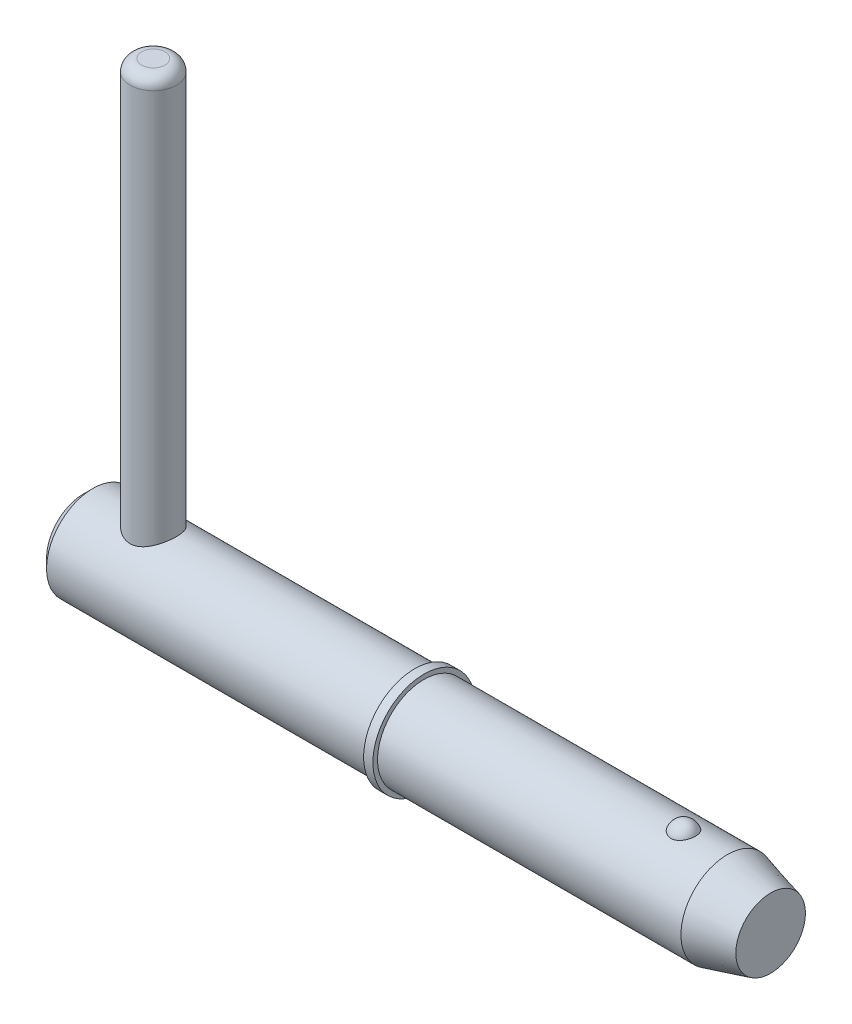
ISO-10303-21;
HEADER;
FILE_DESCRIPTION(('STEP AP214'),'2;1');
FILE_NAME('part.step','',(''),(''),'','','');
FILE_SCHEMA(('AUTOMOTIVE_DESIGN { 1 0 10303 214 1 1 1 1 }'));
ENDSEC;
DATA;
#1=APPLICATION_CONTEXT('core data for automotive mechanical design processes');
#2=APPLICATION_PROTOCOL_DEFINITION('international standard','automotive_design',2000,#1);
#3=PRODUCT_CONTEXT('',#1,'mechanical');
#4=PRODUCT('Part','Part','',(#3));
#5=PRODUCT_RELATED_PRODUCT_CATEGORY('part','',(#4));
#6=PRODUCT_DEFINITION_FORMATION('','',#4);
#7=PRODUCT_DEFINITION_CONTEXT('part definition',#1,'design');
#8=PRODUCT_DEFINITION('design','',#6,#7);
#9=PRODUCT_DEFINITION_SHAPE('','',#8);
#10=(LENGTH_UNIT() NAMED_UNIT(*) SI_UNIT(.MILLI.,.METRE.));
#11=(NAMED_UNIT(*) PLANE_ANGLE_UNIT() SI_UNIT($,.RADIAN.));
#12=(NAMED_UNIT(*) SI_UNIT($,.STERADIAN.) SOLID_ANGLE_UNIT());
#13=UNCERTAINTY_MEASURE_WITH_UNIT(LENGTH_MEASURE(1.E-05),#10,'distance_accuracy_value','');
#14=(GEOMETRIC_REPRESENTATION_CONTEXT(3) GLOBAL_UNCERTAINTY_ASSIGNED_CONTEXT((#13)) GLOBAL_UNIT_ASSIGNED_CONTEXT((#10,
#11,#12)) REPRESENTATION_CONTEXT('',''));
#15=CARTESIAN_POINT('',(0.,0.,0.));
#16=DIRECTION('',(0.,0.,1.));
#17=DIRECTION('',(1.,0.,0.));
#18=AXIS2_PLACEMENT_3D('',#15,#16,#17);
#19=CARTESIAN_POINT('',(3.57,23.02,0.));
#20=DIRECTION('',(0.,-1.,0.));
#21=DIRECTION('',(0.,0.,-1.));
#22=AXIS2_PLACEMENT_3D('',#19,#20,#21);
#23=CYLINDRICAL_SURFACE('',#22,1.19);
#24=CARTESIAN_POINT('',(3.57,-1.785,0.));
#25=DIRECTION('',(0.,1.,0.));
#26=DIRECTION('',(0.,0.,1.));
#27=AXIS2_PLACEMENT_3D('',#24,#25,#26);
#28=CIRCLE('',#27,1.19);
#29=CARTESIAN_POINT('',(3.57,-1.785,1.19));
#30=VERTEX_POINT('',#29);
#31=EDGE_CURVE('P0_E25',#30,#30,#28,.T.);
#32=ORIENTED_EDGE('',*,*,#31,.T.);
#33=EDGE_LOOP('',(#32));
#34=FACE_BOUND('',#33,.T.);
#35=CARTESIAN_POINT('',(3.57,22.425,0.));
#36=DIRECTION('',(0.,1.,0.));
#37=DIRECTION('',(0.,0.,1.));
#38=AXIS2_PLACEMENT_3D('',#35,#36,#37);
#39=CIRCLE('',#38,1.19);
#40=CARTESIAN_POINT('',(3.57,22.425,1.19));
#41=VERTEX_POINT('',#40);
#42=EDGE_CURVE('P0_E29',#41,#41,#39,.F.);
#43=ORIENTED_EDGE('',*,*,#42,.T.);
#44=EDGE_LOOP('',(#43));
#45=FACE_BOUND('',#44,.T.);
#46=ADVANCED_FACE('P0_F14',(#34,#45),#23,.T.);
#47=CARTESIAN_POINT('',(3.57,23.02,0.));
#48=DIRECTION('',(0.,1.,0.));
#49=DIRECTION('',(0.,0.,1.));
#50=AXIS2_PLACEMENT_3D('',#47,#48,#49);
#51=PLANE('',#50);
#52=CARTESIAN_POINT('',(3.57,23.02,0.));
#53=DIRECTION('',(0.,1.,0.));
#54=DIRECTION('',(0.,0.,1.));
#55=AXIS2_PLACEMENT_3D('',#52,#53,#54);
#56=CIRCLE('',#55,0.595);
#57=CARTESIAN_POINT('',(3.57,23.02,0.595));
#58=VERTEX_POINT('',#57);
#59=EDGE_CURVE('P0_E10',#58,#58,#56,.T.);
#60=ORIENTED_EDGE('',*,*,#59,.T.);
#61=EDGE_LOOP('',(#60));
#62=FACE_BOUND('',#61,.T.);
#63=ADVANCED_FACE('P0_F46',(#62),#51,.T.);
#64=CARTESIAN_POINT('',(3.57,-2.38,0.));
#65=DIRECTION('',(0.,1.,0.));
#66=DIRECTION('',(0.,0.,1.));
#67=AXIS2_PLACEMENT_3D('',#64,#65,#66);
#68=PLANE('',#67);
#69=CARTESIAN_POINT('',(3.57,-2.38,0.));
#70=DIRECTION('',(0.,1.,0.));
#71=DIRECTION('',(0.,0.,1.));
#72=AXIS2_PLACEMENT_3D('',#69,#70,#71);
#73=CIRCLE('',#72,0.595);
#74=CARTESIAN_POINT('',(3.57,-2.38,0.595));
#75=VERTEX_POINT('',#74);
#76=EDGE_CURVE('P0_E21',#75,#75,#73,.F.);
#77=ORIENTED_EDGE('',*,*,#76,.T.);
#78=EDGE_LOOP('',(#77));
#79=FACE_BOUND('',#78,.T.);
#80=ADVANCED_FACE('P0_F43',(#79),#68,.F.);
#81=CARTESIAN_POINT('',(3.57,-1.785,0.));
#82=DIRECTION('',(0.,1.,0.));
#83=DIRECTION('',(0.,0.,1.));
#84=AXIS2_PLACEMENT_3D('',#81,#82,#83);
#85=DEGENERATE_TOROIDAL_SURFACE('',#84,0.595,0.595,.T.);
#86=ORIENTED_EDGE('',*,*,#76,.F.);
#87=EDGE_LOOP('',(#86));
#88=FACE_BOUND('',#87,.T.);
#89=ORIENTED_EDGE('',*,*,#31,.F.);
#90=EDGE_LOOP('',(#89));
#91=FACE_BOUND('',#90,.T.);
#92=ADVANCED_FACE('P0_F38',(#88,#91),#85,.T.);
#93=CARTESIAN_POINT('',(3.57,22.425,0.));
#94=DIRECTION('',(0.,1.,0.));
#95=DIRECTION('',(0.,0.,1.));
#96=AXIS2_PLACEMENT_3D('',#93,#94,#95);
#97=DEGENERATE_TOROIDAL_SURFACE('',#96,0.595,0.595,.T.);
#98=ORIENTED_EDGE('',*,*,#42,.F.);
#99=EDGE_LOOP('',(#98));
#100=FACE_BOUND('',#99,.T.);
#101=ORIENTED_EDGE('',*,*,#59,.F.);
#102=EDGE_LOOP('',(#101));
#103=FACE_BOUND('',#102,.T.);
#104=ADVANCED_FACE('P0_F16',(#100,#103),#97,.T.);
#105=CLOSED_SHELL('',(#46,#63,#80,#92,#104));
#106=MANIFOLD_SOLID_BREP('P0_B1',#105);
#107=CARTESIAN_POINT('',(0.,0.,0.));
#108=DIRECTION('',(1.,0.,0.));
#109=DIRECTION('',(0.,0.,-1.));
#110=AXIS2_PLACEMENT_3D('',#107,#108,#109);
#111=CYLINDRICAL_SURFACE('',#110,2.38);
#112=CARTESIAN_POINT('',(33.0094297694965,0.,0.));
#113=DIRECTION('',(1.,0.,0.));
#114=DIRECTION('',(0.,0.,-1.));
#115=AXIS2_PLACEMENT_3D('',#112,#113,#114);
#116=CIRCLE('',#115,2.38);
#117=CARTESIAN_POINT('',(33.0094297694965,0.,-2.38));
#118=VERTEX_POINT('',#117);
#119=EDGE_CURVE('P1_E81',#118,#118,#116,.T.);
#120=ORIENTED_EDGE('',*,*,#119,.F.);
#121=EDGE_LOOP('',(#120));
#122=FACE_BOUND('',#121,.T.);
#123=CARTESIAN_POINT('',(17.45,0.,0.));
#124=DIRECTION('',(1.,0.,0.));
#125=DIRECTION('',(0.,0.,-1.));
#126=AXIS2_PLACEMENT_3D('',#123,#124,#125);
#127=CIRCLE('',#126,2.38);
#128=CARTESIAN_POINT('',(17.45,0.,-2.38));
#129=VERTEX_POINT('',#128);
#130=EDGE_CURVE('P1_E85',#129,#129,#127,.T.);
#131=ORIENTED_EDGE('',*,*,#130,.T.);
#132=EDGE_LOOP('',(#131));
#133=FACE_BOUND('',#132,.T.);
#134=CARTESIAN_POINT('',(30.7634492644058,2.2921568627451,0.640637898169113));
#135=CARTESIAN_POINT('',(30.7303559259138,2.29215737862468,0.640637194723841));
#136=CARTESIAN_POINT('',(30.6972546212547,2.29293179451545,0.637884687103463));
#137=CARTESIAN_POINT('',(30.6320176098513,2.29594030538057,0.626968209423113));
#138=CARTESIAN_POINT('',(30.5998823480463,2.29817506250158,0.618801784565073));
#139=CARTESIAN_POINT('',(30.5375402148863,2.3038430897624,0.597351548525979));
#140=CARTESIAN_POINT('',(30.5073305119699,2.30727454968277,0.584075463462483));
#141=CARTESIAN_POINT('',(30.4495674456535,2.31495941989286,0.552829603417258));
#142=CARTESIAN_POINT('',(30.4220141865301,2.31921286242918,0.534859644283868));
#143=CARTESIAN_POINT('',(30.3695938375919,2.32820213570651,0.494282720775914));
#144=CARTESIAN_POINT('',(30.3448050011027,2.33294694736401,0.471576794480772));
#145=CARTESIAN_POINT('',(30.2992169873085,2.34234144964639,0.422446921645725));
#146=CARTESIAN_POINT('',(30.2784185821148,2.34699112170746,0.396022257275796));
#147=CARTESIAN_POINT('',(30.2403580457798,2.35593942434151,0.338855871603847));
#148=CARTESIAN_POINT('',(30.2233051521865,2.36021170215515,0.307970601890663));
#149=CARTESIAN_POINT('',(30.1943607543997,2.3677057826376,0.243750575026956));
#150=CARTESIAN_POINT('',(30.1824701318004,2.37092740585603,0.210415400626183));
#151=CARTESIAN_POINT('',(30.1638076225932,2.37606901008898,0.141189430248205));
#152=CARTESIAN_POINT('',(30.1571956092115,2.37794816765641,0.105252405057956));
#153=CARTESIAN_POINT('',(30.1498095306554,2.38005135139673,0.0327351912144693));
#154=CARTESIAN_POINT('',(30.1490358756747,2.38027526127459,-0.00384504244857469));
#155=CARTESIAN_POINT('',(30.1533628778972,2.37903842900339,-0.0769838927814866));
#156=CARTESIAN_POINT('',(30.1585202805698,2.37756141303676,-0.113538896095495));
#157=CARTESIAN_POINT('',(30.1747013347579,2.37305303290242,-0.185229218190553));
#158=CARTESIAN_POINT('',(30.1857251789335,2.37002161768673,-0.220364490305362));
#159=CARTESIAN_POINT('',(30.2133977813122,2.36273722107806,-0.288156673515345));
#160=CARTESIAN_POINT('',(30.2300389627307,2.35848588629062,-0.320816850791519));
#161=CARTESIAN_POINT('',(30.2685984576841,2.34923130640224,-0.382744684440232));
#162=CARTESIAN_POINT('',(30.290516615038,2.34422808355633,-0.412012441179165));
#163=CARTESIAN_POINT('',(30.3387549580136,2.33412555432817,-0.465830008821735));
#164=CARTESIAN_POINT('',(30.3650028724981,2.32902887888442,-0.490444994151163));
#165=CARTESIAN_POINT('',(30.4214769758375,2.31926941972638,-0.534700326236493));
#166=CARTESIAN_POINT('',(30.451702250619,2.3146065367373,-0.554341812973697));
#167=CARTESIAN_POINT('',(30.5140618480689,2.30645675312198,-0.587312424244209));
#168=CARTESIAN_POINT('',(30.5460780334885,2.30293152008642,-0.600855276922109));
#169=CARTESIAN_POINT('',(30.6120795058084,2.29725171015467,-0.622220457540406));
#170=CARTESIAN_POINT('',(30.6460641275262,2.29509667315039,-0.630044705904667));
#171=CARTESIAN_POINT('',(30.713299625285,2.29249264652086,-0.639452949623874));
#172=CARTESIAN_POINT('',(30.7465087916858,2.29196755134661,-0.641315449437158));
#173=CARTESIAN_POINT('',(30.812763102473,2.29246849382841,-0.639522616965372));
#174=CARTESIAN_POINT('',(30.8458082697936,2.29349430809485,-0.635868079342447));
#175=CARTESIAN_POINT('',(30.9101025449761,2.29694059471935,-0.623301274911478));
#176=CARTESIAN_POINT('',(30.9413744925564,2.29933234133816,-0.614497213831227));
#177=CARTESIAN_POINT('',(31.0019952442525,2.30522511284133,-0.592006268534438));
#178=CARTESIAN_POINT('',(31.0313438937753,2.30872622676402,-0.57831899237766));
#179=CARTESIAN_POINT('',(31.0880369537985,2.31655795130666,-0.546112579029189));
#180=CARTESIAN_POINT('',(31.115320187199,2.32090569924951,-0.527490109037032));
#181=CARTESIAN_POINT('',(31.1664904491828,2.32992206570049,-0.486117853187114));
#182=CARTESIAN_POINT('',(31.1903767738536,2.33459075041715,-0.463367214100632));
#183=CARTESIAN_POINT('',(31.2352722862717,2.34399834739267,-0.413220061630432));
#184=CARTESIAN_POINT('',(31.2560972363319,2.34873051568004,-0.385657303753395));
#185=CARTESIAN_POINT('',(31.293056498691,2.35754932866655,-0.327455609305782));
#186=CARTESIAN_POINT('',(31.3091898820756,2.36163584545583,-0.296816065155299));
#187=CARTESIAN_POINT('',(31.3369822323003,2.36889321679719,-0.232047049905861));
#188=CARTESIAN_POINT('',(31.3484450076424,2.37202275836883,-0.197828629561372));
#189=CARTESIAN_POINT('',(31.3657523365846,2.37681926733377,-0.127900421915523));
#190=CARTESIAN_POINT('',(31.3715962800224,2.37848607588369,-0.0921904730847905));
#191=CARTESIAN_POINT('',(31.377605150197,2.38020024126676,-0.0196348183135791));
#192=CARTESIAN_POINT('',(31.3776704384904,2.38021918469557,0.0172198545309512));
#193=CARTESIAN_POINT('',(31.3718689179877,2.37856356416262,0.0904219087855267));
#194=CARTESIAN_POINT('',(31.3660018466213,2.37688892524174,0.12676926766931));
#195=CARTESIAN_POINT('',(31.348425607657,2.37201688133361,0.198028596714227));
#196=CARTESIAN_POINT('',(31.3366998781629,2.36881516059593,0.232936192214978));
#197=CARTESIAN_POINT('',(31.3076354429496,2.36123444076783,0.300196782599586));
#198=CARTESIAN_POINT('',(31.2902967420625,2.3568554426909,0.332549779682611));
#199=CARTESIAN_POINT('',(31.2505350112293,2.34744667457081,0.393495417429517));
#200=CARTESIAN_POINT('',(31.2281528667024,2.34242227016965,0.422115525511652));
#201=CARTESIAN_POINT('',(31.1787391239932,2.33227293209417,0.475004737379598));
#202=CARTESIAN_POINT('',(31.1517076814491,2.32714800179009,0.499273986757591));
#203=CARTESIAN_POINT('',(31.0944988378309,2.31755359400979,0.542046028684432));
#204=CARTESIAN_POINT('',(31.0644297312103,2.3130698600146,0.560690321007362));
#205=CARTESIAN_POINT('',(31.0013869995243,2.30514125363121,0.592447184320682));
#206=CARTESIAN_POINT('',(30.9684158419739,2.30169550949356,0.605564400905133));
#207=CARTESIAN_POINT('',(30.9068424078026,2.29677744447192,0.623927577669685));
#208=CARTESIAN_POINT('',(30.8785555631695,2.295058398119,0.630178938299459));
#209=CARTESIAN_POINT('',(30.8213308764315,2.29274795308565,0.638534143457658));
#210=CARTESIAN_POINT('',(30.7923931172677,2.29215641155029,0.640638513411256));
#211=CARTESIAN_POINT('',(30.7634492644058,2.2921568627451,0.640637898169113));
#212=B_SPLINE_CURVE_WITH_KNOTS('',3,(#134,#135,#136,#137,#138,#139,#140,#141,#142,#143,#144,
#145,#146,#147,#148,#149,#150,#151,#152,#153,#154,#155,#156,#157,#158,#159,#160,#161,#162,#163,
#164,#165,#166,#167,#168,#169,#170,#171,#172,#173,#174,#175,#176,#177,#178,#179,#180,#181,#182,
#183,#184,#185,#186,#187,#188,#189,#190,#191,#192,#193,#194,#195,#196,#197,#198,#199,#200,#201,
#202,#203,#204,#205,#206,#207,#208,#209,#210,#211),.UNSPECIFIED.,.T.,.F.,(4,2,2,2,2,2,2,2,2,2,2,
2,2,2,2,2,2,2,2,2,2,2,2,2,2,2,2,2,2,2,2,2,2,2,2,2,2,2,4),(0.,0.0991724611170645,
0.19838992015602,0.297457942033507,0.396529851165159,0.49792776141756,0.599345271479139,
0.705475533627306,0.811623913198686,0.920876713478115,1.03013718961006,1.14045177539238,
1.25076998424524,1.36093998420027,1.47110672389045,1.57959248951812,1.68805336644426,
1.79234266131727,1.89659691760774,1.99590391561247,2.09519661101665,2.19247425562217,
2.28975970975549,2.38926978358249,2.48880044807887,2.59293588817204,2.69709193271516,
2.80525821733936,2.91343624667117,3.02347917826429,3.13352698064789,3.24388765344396,
3.35424823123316,3.46374443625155,3.5732369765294,3.67968690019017,3.78604717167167,
3.87279565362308,3.9595331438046),.UNSPECIFIED.);
#213=CARTESIAN_POINT('',(30.7634492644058,2.2921568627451,0.640637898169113));
#214=VERTEX_POINT('',#213);
#215=EDGE_CURVE('P1_E35',#214,#214,#212,.T.);
#216=ORIENTED_EDGE('',*,*,#215,.T.);
#217=EDGE_LOOP('',(#216));
#218=FACE_BOUND('',#217,.T.);
#219=ADVANCED_FACE('P1_F13',(#122,#133,#218),#111,.T.);
#220=CARTESIAN_POINT('',(0.,0.,0.));
#221=DIRECTION('',(-1.,0.,0.));
#222=DIRECTION('',(0.,0.,1.));
#223=AXIS2_PLACEMENT_3D('',#220,#221,#222);
#224=PLANE('',#223);
#225=CARTESIAN_POINT('',(0.,0.,0.));
#226=DIRECTION('',(1.,0.,0.));
#227=DIRECTION('',(0.,0.,-1.));
#228=AXIS2_PLACEMENT_3D('',#225,#226,#227);
#229=CIRCLE('',#228,1.904);
#230=CARTESIAN_POINT('',(0.,0.,-1.904));
#231=VERTEX_POINT('',#230);
#232=EDGE_CURVE('P1_E9',#231,#231,#229,.T.);
#233=ORIENTED_EDGE('',*,*,#232,.F.);
#234=EDGE_LOOP('',(#233));
#235=FACE_BOUND('',#234,.T.);
#236=ADVANCED_FACE('P1_F15',(#235),#224,.T.);
#237=CARTESIAN_POINT('',(0.475999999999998,0.,0.));
#238=DIRECTION('',(1.,0.,0.));
#239=DIRECTION('',(0.,0.,-1.));
#240=AXIS2_PLACEMENT_3D('',#237,#238,#239);
#241=CONICAL_SURFACE('',#240,2.38,0.78539816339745);
#242=ORIENTED_EDGE('',*,*,#232,.T.);
#243=EDGE_LOOP('',(#242));
#244=FACE_BOUND('',#243,.T.);
#245=CARTESIAN_POINT('',(0.475999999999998,0.,0.));
#246=DIRECTION('',(1.,0.,0.));
#247=DIRECTION('',(0.,0.,-1.));
#248=AXIS2_PLACEMENT_3D('',#245,#246,#247);
#249=CIRCLE('',#248,2.38);
#250=CARTESIAN_POINT('',(0.475999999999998,0.,-2.38));
#251=VERTEX_POINT('',#250);
#252=EDGE_CURVE('P1_E26',#251,#251,#249,.T.);
#253=ORIENTED_EDGE('',*,*,#252,.F.);
#254=EDGE_LOOP('',(#253));
#255=FACE_BOUND('',#254,.T.);
#256=ADVANCED_FACE('P1_F77',(#244,#255),#241,.T.);
#257=CARTESIAN_POINT('',(0.,0.,0.));
#258=DIRECTION('',(1.,0.,0.));
#259=DIRECTION('',(0.,0.,-1.));
#260=AXIS2_PLACEMENT_3D('',#257,#258,#259);
#261=CYLINDRICAL_SURFACE('',#260,2.38);
#262=CARTESIAN_POINT('',(3.57,-2.06114046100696,1.19));
#263=CARTESIAN_POINT('',(3.50799170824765,-2.06114586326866,1.18999567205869));
#264=CARTESIAN_POINT('',(3.4459051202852,-2.0639812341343,1.18512096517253));
#265=CARTESIAN_POINT('',(3.32363755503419,-2.07491216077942,1.16587061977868));
#266=CARTESIAN_POINT('',(3.26346086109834,-2.08301876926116,1.15147501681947));
#267=CARTESIAN_POINT('',(3.14701251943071,-2.10331722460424,1.11395893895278));
#268=CARTESIAN_POINT('',(3.09072196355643,-2.1154873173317,1.09088484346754));
#269=CARTESIAN_POINT('',(2.9828251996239,-2.14250771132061,1.03680835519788));
#270=CARTESIAN_POINT('',(2.93121924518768,-2.15735815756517,1.00580553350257));
#271=CARTESIAN_POINT('',(2.82945618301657,-2.18956274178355,0.933753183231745));
#272=CARTESIAN_POINT('',(2.77976962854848,-2.20702235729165,0.892085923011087));
#273=CARTESIAN_POINT('',(2.68772401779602,-2.2416265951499,0.801172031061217));
#274=CARTESIAN_POINT('',(2.64536861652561,-2.25877105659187,0.751921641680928));
#275=CARTESIAN_POINT('',(2.56639309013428,-2.29219557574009,0.64318258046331));
#276=CARTESIAN_POINT('',(2.53035201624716,-2.30833946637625,0.583227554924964));
#277=CARTESIAN_POINT('',(2.46908238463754,-2.3365739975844,0.45714686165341));
#278=CARTESIAN_POINT('',(2.44384700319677,-2.34866719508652,0.391025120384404));
#279=CARTESIAN_POINT('',(2.40676945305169,-2.36667748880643,0.259473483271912));
#280=CARTESIAN_POINT('',(2.39410206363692,-2.37297281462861,0.194329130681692));
#281=CARTESIAN_POINT('',(2.3798023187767,-2.3800902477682,0.0625590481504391));
#282=CARTESIAN_POINT('',(2.37816328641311,-2.38091566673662,-0.00406576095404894));
#283=CARTESIAN_POINT('',(2.38564854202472,-2.37717948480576,-0.130700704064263));
#284=CARTESIAN_POINT('',(2.39384923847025,-2.37308010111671,-0.190782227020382));
#285=CARTESIAN_POINT('',(2.41912820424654,-2.360653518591,-0.308583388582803));
#286=CARTESIAN_POINT('',(2.43620713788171,-2.35232600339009,-0.366302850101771));
#287=CARTESIAN_POINT('',(2.47886825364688,-2.33206184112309,-0.478748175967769));
#288=CARTESIAN_POINT('',(2.50456481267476,-2.32007685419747,-0.533421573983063));
#289=CARTESIAN_POINT('',(2.56357346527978,-2.29357798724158,-0.637812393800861));
#290=CARTESIAN_POINT('',(2.5968882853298,-2.27906320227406,-0.687528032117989));
#291=CARTESIAN_POINT('',(2.67380546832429,-2.24724829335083,-0.785606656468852));
#292=CARTESIAN_POINT('',(2.71808260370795,-2.22981457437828,-0.833397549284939));
#293=CARTESIAN_POINT('',(2.81386177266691,-2.19500665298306,-0.921184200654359));
#294=CARTESIAN_POINT('',(2.86536931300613,-2.17763250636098,-0.961173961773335));
#295=CARTESIAN_POINT('',(2.97815134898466,-2.14371545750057,-1.03471134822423));
#296=CARTESIAN_POINT('',(3.03983836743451,-2.12729540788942,-1.06768860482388));
#297=CARTESIAN_POINT('',(3.16889582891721,-2.09886785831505,-1.12254974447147));
#298=CARTESIAN_POINT('',(3.2362602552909,-2.0868557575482,-1.14444520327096));
#299=CARTESIAN_POINT('',(3.36914526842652,-2.06994116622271,-1.1747444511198));
#300=CARTESIAN_POINT('',(3.43438893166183,-2.06455070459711,-1.18407989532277));
#301=CARTESIAN_POINT('',(3.56571759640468,-2.06010324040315,-1.1918051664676));
#302=CARTESIAN_POINT('',(3.63180197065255,-2.06104176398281,-1.19020272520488));
#303=CARTESIAN_POINT('',(3.75522816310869,-2.06862860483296,-1.17695289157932));
#304=CARTESIAN_POINT('',(3.81273554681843,-2.07464109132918,-1.16642350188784));
#305=CARTESIAN_POINT('',(3.92505766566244,-2.09075885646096,-1.1372785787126));
#306=CARTESIAN_POINT('',(3.97987152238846,-2.1008654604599,-1.1186604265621));
#307=CARTESIAN_POINT('',(4.08813948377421,-2.12458104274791,-1.07296063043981));
#308=CARTESIAN_POINT('',(4.14141303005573,-2.13833055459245,-1.04552693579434));
#309=CARTESIAN_POINT('',(4.2429084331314,-2.16765782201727,-0.983281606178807));
#310=CARTESIAN_POINT('',(4.29112767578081,-2.18323651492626,-0.948466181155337));
#311=CARTESIAN_POINT('',(4.38750473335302,-2.2168271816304,-0.867316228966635));
#312=CARTESIAN_POINT('',(4.43488860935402,-2.23489833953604,-0.82008287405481));
#313=CARTESIAN_POINT('',(4.52130056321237,-2.26973739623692,-0.718051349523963));
#314=CARTESIAN_POINT('',(4.56032581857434,-2.28650485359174,-0.663250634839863));
#315=CARTESIAN_POINT('',(4.62978273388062,-2.31742220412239,-0.545657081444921));
#316=CARTESIAN_POINT('',(4.65996041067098,-2.33149133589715,-0.482691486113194));
#317=CARTESIAN_POINT('',(4.7089941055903,-2.35481192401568,-0.351671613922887));
#318=CARTESIAN_POINT('',(4.7278600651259,-2.36406760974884,-0.283621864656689));
#319=CARTESIAN_POINT('',(4.75210859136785,-2.3760433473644,-0.151105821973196));
#320=CARTESIAN_POINT('',(4.75856947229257,-2.37928514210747,-0.0868836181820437));
#321=CARTESIAN_POINT('',(4.76100348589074,-2.38050135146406,0.0417999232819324));
#322=CARTESIAN_POINT('',(4.75698028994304,-2.37847760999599,0.106261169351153));
#323=CARTESIAN_POINT('',(4.73927447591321,-2.36969422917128,0.229120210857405));
#324=CARTESIAN_POINT('',(4.72624582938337,-2.36325544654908,0.287637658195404));
#325=CARTESIAN_POINT('',(4.69178087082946,-2.34658591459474,0.401560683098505));
#326=CARTESIAN_POINT('',(4.67034335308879,-2.33635462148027,0.456965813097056));
#327=CARTESIAN_POINT('',(4.61871480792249,-2.31247857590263,0.565753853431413));
#328=CARTESIAN_POINT('',(4.58818860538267,-2.29870654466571,0.618948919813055));
#329=CARTESIAN_POINT('',(4.51967006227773,-2.26918878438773,0.719681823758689));
#330=CARTESIAN_POINT('',(4.48167429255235,-2.25344215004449,0.76721704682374));
#331=CARTESIAN_POINT('',(4.39491140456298,-2.21969046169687,0.860267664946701));
#332=CARTESIAN_POINT('',(4.34544863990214,-2.20161660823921,0.905111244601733));
#333=CARTESIAN_POINT('',(4.23943364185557,-2.16655060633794,0.986109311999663));
#334=CARTESIAN_POINT('',(4.18287520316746,-2.1495594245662,1.02225611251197));
#335=CARTESIAN_POINT('',(4.06190239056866,-2.1181953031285,1.08579298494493));
#336=CARTESIAN_POINT('',(3.9972962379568,-2.10392207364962,1.11287022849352));
#337=CARTESIAN_POINT('',(3.86353443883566,-2.08090726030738,1.15534566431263));
#338=CARTESIAN_POINT('',(3.7943948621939,-2.07214719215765,1.17078291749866));
#339=CARTESIAN_POINT('',(3.69875162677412,-2.06499834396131,1.18329673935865));
#340=CARTESIAN_POINT('',(3.67309220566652,-2.06355673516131,1.18580656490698));
#341=CARTESIAN_POINT('',(3.62162638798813,-2.06162663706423,1.18915915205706));
#342=CARTESIAN_POINT('',(3.59581998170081,-2.0611382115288,1.19000180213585));
#343=CARTESIAN_POINT('',(3.57,-2.06114046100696,1.19));
#344=B_SPLINE_CURVE_WITH_KNOTS('',3,(#262,#263,#264,#265,#266,#267,#268,#269,#270,#271,#272,
#273,#274,#275,#276,#277,#278,#279,#280,#281,#282,#283,#284,#285,#286,#287,#288,#289,#290,#291,
#292,#293,#294,#295,#296,#297,#298,#299,#300,#301,#302,#303,#304,#305,#306,#307,#308,#309,#310,
#311,#312,#313,#314,#315,#316,#317,#318,#319,#320,#321,#322,#323,#324,#325,#326,#327,#328,#329,
#330,#331,#332,#333,#334,#335,#336,#337,#338,#339,#340,#341,#342,#343),.UNSPECIFIED.,.T.,.F.,(4,
2,2,2,2,2,2,2,2,2,2,2,2,2,2,2,2,2,2,2,2,2,2,2,2,2,2,2,2,2,2,2,2,2,2,2,2,2,2,2,4),(0.,
0.185916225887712,0.372223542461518,0.557549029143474,0.742884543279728,0.943506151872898,
1.14422749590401,1.35847891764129,1.5725948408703,1.77147547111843,1.97023568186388,
2.15171156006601,2.33320101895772,2.51720146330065,2.70126786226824,2.902733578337,
3.10435357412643,3.31877721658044,3.53297641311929,3.73020126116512,3.92728670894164,
4.1028127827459,4.27839572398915,4.46211082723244,4.64592048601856,4.8529002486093,
5.0599497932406,5.27246375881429,5.48479067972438,5.67763601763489,5.87041383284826,
6.05048865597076,6.23058930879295,6.41839293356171,6.60628297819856,6.8128718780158,
7.01964271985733,7.2329479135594,7.44553408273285,7.52294360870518,7.60035831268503),.UNSPECIFIED.);
#345=CARTESIAN_POINT('',(3.57,-2.06114046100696,1.19));
#346=VERTEX_POINT('',#345);
#347=EDGE_CURVE('P1_E17',#346,#346,#344,.T.);
#348=ORIENTED_EDGE('',*,*,#347,.F.);
#349=EDGE_LOOP('',(#348));
#350=FACE_BOUND('',#349,.T.);
#351=CARTESIAN_POINT('',(3.57,2.06114046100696,1.19));
#352=CARTESIAN_POINT('',(3.63200829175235,2.06114586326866,1.18999567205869));
#353=CARTESIAN_POINT('',(3.6940948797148,2.0639812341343,1.18512096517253));
#354=CARTESIAN_POINT('',(3.81636244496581,2.07491216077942,1.16587061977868));
#355=CARTESIAN_POINT('',(3.87653913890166,2.08301876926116,1.15147501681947));
#356=CARTESIAN_POINT('',(3.99298748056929,2.10331722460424,1.11395893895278));
#357=CARTESIAN_POINT('',(4.04927803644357,2.1154873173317,1.09088484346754));
#358=CARTESIAN_POINT('',(4.1571748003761,2.14250771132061,1.03680835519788));
#359=CARTESIAN_POINT('',(4.20878075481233,2.15735815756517,1.00580553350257));
#360=CARTESIAN_POINT('',(4.31054381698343,2.18956274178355,0.933753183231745));
#361=CARTESIAN_POINT('',(4.36023037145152,2.20702235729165,0.892085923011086));
#362=CARTESIAN_POINT('',(4.45227598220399,2.2416265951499,0.801172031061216));
#363=CARTESIAN_POINT('',(4.49463138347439,2.25877105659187,0.751921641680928));
#364=CARTESIAN_POINT('',(4.57360690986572,2.29219557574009,0.643182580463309));
#365=CARTESIAN_POINT('',(4.60964798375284,2.30833946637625,0.583227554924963));
#366=CARTESIAN_POINT('',(4.67091761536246,2.3365739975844,0.457146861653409));
#367=CARTESIAN_POINT('',(4.69615299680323,2.34866719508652,0.391025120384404));
#368=CARTESIAN_POINT('',(4.73323054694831,2.36667748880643,0.259473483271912));
#369=CARTESIAN_POINT('',(4.74589793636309,2.37297281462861,0.194329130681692));
#370=CARTESIAN_POINT('',(4.7601976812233,2.3800902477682,0.0625590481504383));
#371=CARTESIAN_POINT('',(4.76183671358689,2.38091566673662,-0.00406576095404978));
#372=CARTESIAN_POINT('',(4.75435145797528,2.37717948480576,-0.130700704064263));
#373=CARTESIAN_POINT('',(4.74615076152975,2.37308010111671,-0.190782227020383));
#374=CARTESIAN_POINT('',(4.72087179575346,2.360653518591,-0.308583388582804));
#375=CARTESIAN_POINT('',(4.70379286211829,2.35232600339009,-0.366302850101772));
#376=CARTESIAN_POINT('',(4.66113174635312,2.33206184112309,-0.478748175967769));
#377=CARTESIAN_POINT('',(4.63543518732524,2.32007685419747,-0.533421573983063));
#378=CARTESIAN_POINT('',(4.57642653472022,2.29357798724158,-0.637812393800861));
#379=CARTESIAN_POINT('',(4.5431117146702,2.27906320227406,-0.687528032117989));
#380=CARTESIAN_POINT('',(4.46619453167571,2.24724829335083,-0.785606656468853));
#381=CARTESIAN_POINT('',(4.42191739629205,2.22981457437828,-0.83339754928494));
#382=CARTESIAN_POINT('',(4.32613822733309,2.19500665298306,-0.921184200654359));
#383=CARTESIAN_POINT('',(4.27463068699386,2.17763250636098,-0.961173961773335));
#384=CARTESIAN_POINT('',(4.16184865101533,2.14371545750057,-1.03471134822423));
#385=CARTESIAN_POINT('',(4.10016163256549,2.12729540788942,-1.06768860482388));
#386=CARTESIAN_POINT('',(3.97110417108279,2.09886785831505,-1.12254974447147));
#387=CARTESIAN_POINT('',(3.9037397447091,2.0868557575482,-1.14444520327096));
#388=CARTESIAN_POINT('',(3.77085473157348,2.06994116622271,-1.1747444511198));
#389=CARTESIAN_POINT('',(3.70561106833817,2.06455070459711,-1.18407989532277));
#390=CARTESIAN_POINT('',(3.57428240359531,2.06010324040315,-1.1918051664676));
#391=CARTESIAN_POINT('',(3.50819802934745,2.06104176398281,-1.19020272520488));
#392=CARTESIAN_POINT('',(3.38477183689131,2.06862860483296,-1.17695289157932));
#393=CARTESIAN_POINT('',(3.32726445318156,2.07464109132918,-1.16642350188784));
#394=CARTESIAN_POINT('',(3.21494233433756,2.09075885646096,-1.1372785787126));
#395=CARTESIAN_POINT('',(3.16012847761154,2.1008654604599,-1.1186604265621));
#396=CARTESIAN_POINT('',(3.05186051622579,2.12458104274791,-1.07296063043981));
#397=CARTESIAN_POINT('',(2.99858696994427,2.13833055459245,-1.04552693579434));
#398=CARTESIAN_POINT('',(2.8970915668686,2.16765782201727,-0.983281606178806));
#399=CARTESIAN_POINT('',(2.84887232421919,2.18323651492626,-0.948466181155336));
#400=CARTESIAN_POINT('',(2.75249526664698,2.2168271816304,-0.867316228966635));
#401=CARTESIAN_POINT('',(2.70511139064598,2.23489833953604,-0.820082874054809));
#402=CARTESIAN_POINT('',(2.61869943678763,2.26973739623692,-0.718051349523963));
#403=CARTESIAN_POINT('',(2.57967418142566,2.28650485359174,-0.663250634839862));
#404=CARTESIAN_POINT('',(2.51021726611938,2.31742220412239,-0.54565708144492));
#405=CARTESIAN_POINT('',(2.48003958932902,2.33149133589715,-0.482691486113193));
#406=CARTESIAN_POINT('',(2.4310058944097,2.35481192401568,-0.351671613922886));
#407=CARTESIAN_POINT('',(2.4121399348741,2.36406760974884,-0.283621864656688));
#408=CARTESIAN_POINT('',(2.38789140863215,2.3760433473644,-0.151105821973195));
#409=CARTESIAN_POINT('',(2.38143052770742,2.37928514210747,-0.0868836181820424));
#410=CARTESIAN_POINT('',(2.37899651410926,2.38050135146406,0.0417999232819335));
#411=CARTESIAN_POINT('',(2.38301971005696,2.37847760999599,0.106261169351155));
#412=CARTESIAN_POINT('',(2.40072552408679,2.36969422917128,0.229120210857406));
#413=CARTESIAN_POINT('',(2.41375417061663,2.36325544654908,0.287637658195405));
#414=CARTESIAN_POINT('',(2.44821912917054,2.34658591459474,0.401560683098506));
#415=CARTESIAN_POINT('',(2.46965664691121,2.33635462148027,0.456965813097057));
#416=CARTESIAN_POINT('',(2.52128519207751,2.31247857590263,0.565753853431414));
#417=CARTESIAN_POINT('',(2.55181139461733,2.29870654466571,0.618948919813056));
#418=CARTESIAN_POINT('',(2.62032993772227,2.26918878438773,0.719681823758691));
#419=CARTESIAN_POINT('',(2.65832570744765,2.25344215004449,0.767217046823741));
#420=CARTESIAN_POINT('',(2.74508859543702,2.21969046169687,0.860267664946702));
#421=CARTESIAN_POINT('',(2.79455136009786,2.20161660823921,0.905111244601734));
#422=CARTESIAN_POINT('',(2.90056635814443,2.16655060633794,0.986109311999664));
#423=CARTESIAN_POINT('',(2.95712479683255,2.1495594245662,1.02225611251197));
#424=CARTESIAN_POINT('',(3.07809760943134,2.1181953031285,1.08579298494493));
#425=CARTESIAN_POINT('',(3.1427037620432,2.10392207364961,1.11287022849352));
#426=CARTESIAN_POINT('',(3.27646556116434,2.08090726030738,1.15534566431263));
#427=CARTESIAN_POINT('',(3.3456051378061,2.07214719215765,1.17078291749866));
#428=CARTESIAN_POINT('',(3.44124837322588,2.06499834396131,1.18329673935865));
#429=CARTESIAN_POINT('',(3.46690779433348,2.06355673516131,1.18580656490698));
#430=CARTESIAN_POINT('',(3.51837361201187,2.06162663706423,1.18915915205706));
#431=CARTESIAN_POINT('',(3.54418001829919,2.0611382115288,1.19000180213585));
#432=CARTESIAN_POINT('',(3.57,2.06114046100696,1.19));
#433=B_SPLINE_CURVE_WITH_KNOTS('',3,(#351,#352,#353,#354,#355,#356,#357,#358,#359,#360,#361,
#362,#363,#364,#365,#366,#367,#368,#369,#370,#371,#372,#373,#374,#375,#376,#377,#378,#379,#380,
#381,#382,#383,#384,#385,#386,#387,#388,#389,#390,#391,#392,#393,#394,#395,#396,#397,#398,#399,
#400,#401,#402,#403,#404,#405,#406,#407,#408,#409,#410,#411,#412,#413,#414,#415,#416,#417,#418,
#419,#420,#421,#422,#423,#424,#425,#426,#427,#428,#429,#430,#431,#432),.UNSPECIFIED.,.T.,.F.,(4,
2,2,2,2,2,2,2,2,2,2,2,2,2,2,2,2,2,2,2,2,2,2,2,2,2,2,2,2,2,2,2,2,2,2,2,2,2,2,2,4),(0.,
0.185916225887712,0.372223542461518,0.557549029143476,0.74288454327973,0.9435061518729,
1.14422749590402,1.35847891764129,1.5725948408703,1.77147547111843,1.97023568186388,
2.15171156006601,2.33320101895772,2.51720146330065,2.70126786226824,2.902733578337,
3.10435357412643,3.31877721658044,3.53297641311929,3.73020126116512,3.92728670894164,
4.1028127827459,4.27839572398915,4.46211082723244,4.64592048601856,4.8529002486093,
5.05994979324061,5.27246375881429,5.48479067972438,5.67763601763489,5.87041383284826,
6.05048865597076,6.23058930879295,6.41839293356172,6.60628297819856,6.8128718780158,
7.01964271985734,7.2329479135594,7.44553408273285,7.52294360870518,7.60035831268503),.UNSPECIFIED.);
#434=CARTESIAN_POINT('',(3.57,2.06114046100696,1.19));
#435=VERTEX_POINT('',#434);
#436=EDGE_CURVE('P1_E43',#435,#435,#433,.T.);
#437=ORIENTED_EDGE('',*,*,#436,.F.);
#438=EDGE_LOOP('',(#437));
#439=FACE_BOUND('',#438,.T.);
#440=ORIENTED_EDGE('',*,*,#252,.T.);
#441=EDGE_LOOP('',(#440));
#442=FACE_BOUND('',#441,.T.);
#443=CARTESIAN_POINT('',(16.974,0.,0.));
#444=DIRECTION('',(1.,0.,0.));
#445=DIRECTION('',(0.,0.,-1.));
#446=AXIS2_PLACEMENT_3D('',#443,#444,#445);
#447=CIRCLE('',#446,2.38);
#448=CARTESIAN_POINT('',(16.974,0.,-2.38));
#449=VERTEX_POINT('',#448);
#450=EDGE_CURVE('P1_E31',#449,#449,#447,.T.);
#451=ORIENTED_EDGE('',*,*,#450,.F.);
#452=EDGE_LOOP('',(#451));
#453=FACE_BOUND('',#452,.T.);
#454=ADVANCED_FACE('P1_F103',(#350,#439,#442,#453),#261,.T.);
#455=CARTESIAN_POINT('',(16.974,2.38,0.));
#456=DIRECTION('',(-1.,0.,0.));
#457=DIRECTION('',(0.,0.,1.));
#458=AXIS2_PLACEMENT_3D('',#455,#456,#457);
#459=PLANE('',#458);
#460=ORIENTED_EDGE('',*,*,#450,.T.);
#461=EDGE_LOOP('',(#460));
#462=FACE_BOUND('',#461,.T.);
#463=CARTESIAN_POINT('',(16.974,0.,0.));
#464=DIRECTION('',(1.,0.,0.));
#465=DIRECTION('',(0.,0.,-1.));
#466=AXIS2_PLACEMENT_3D('',#463,#464,#465);
#467=CIRCLE('',#466,2.618);
#468=CARTESIAN_POINT('',(16.974,0.,-2.618));
#469=VERTEX_POINT('',#468);
#470=EDGE_CURVE('P1_E91',#469,#469,#467,.T.);
#471=ORIENTED_EDGE('',*,*,#470,.F.);
#472=EDGE_LOOP('',(#471));
#473=FACE_BOUND('',#472,.T.);
#474=ADVANCED_FACE('P1_F100',(#462,#473),#459,.T.);
#475=CARTESIAN_POINT('',(0.,0.,0.));
#476=DIRECTION('',(1.,0.,0.));
#477=DIRECTION('',(0.,0.,-1.));
#478=AXIS2_PLACEMENT_3D('',#475,#476,#477);
#479=CYLINDRICAL_SURFACE('',#478,2.618);
#480=ORIENTED_EDGE('',*,*,#470,.T.);
#481=EDGE_LOOP('',(#480));
#482=FACE_BOUND('',#481,.T.);
#483=CARTESIAN_POINT('',(17.45,0.,0.));
#484=DIRECTION('',(1.,0.,0.));
#485=DIRECTION('',(0.,0.,-1.));
#486=AXIS2_PLACEMENT_3D('',#483,#484,#485);
#487=CIRCLE('',#486,2.618);
#488=CARTESIAN_POINT('',(17.45,0.,-2.618));
#489=VERTEX_POINT('',#488);
#490=EDGE_CURVE('P1_E88',#489,#489,#487,.T.);
#491=ORIENTED_EDGE('',*,*,#490,.F.);
#492=EDGE_LOOP('',(#491));
#493=FACE_BOUND('',#492,.T.);
#494=ADVANCED_FACE('P1_F68',(#482,#493),#479,.T.);
#495=CARTESIAN_POINT('',(17.45,2.618,0.));
#496=DIRECTION('',(1.,0.,0.));
#497=DIRECTION('',(0.,0.,-1.));
#498=AXIS2_PLACEMENT_3D('',#495,#496,#497);
#499=PLANE('',#498);
#500=ORIENTED_EDGE('',*,*,#490,.T.);
#501=EDGE_LOOP('',(#500));
#502=FACE_BOUND('',#501,.T.);
#503=ORIENTED_EDGE('',*,*,#130,.F.);
#504=EDGE_LOOP('',(#503));
#505=FACE_BOUND('',#504,.T.);
#506=ADVANCED_FACE('P1_F62',(#502,#505),#499,.T.);
#507=CARTESIAN_POINT('',(35.23,0.,0.));
#508=DIRECTION('',(-1.,0.,0.));
#509=DIRECTION('',(0.,0.,1.));
#510=AXIS2_PLACEMENT_3D('',#507,#508,#509);
#511=CONICAL_SURFACE('',#510,1.785,0.261799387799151);
#512=ORIENTED_EDGE('',*,*,#119,.T.);
#513=EDGE_LOOP('',(#512));
#514=FACE_BOUND('',#513,.T.);
#515=CARTESIAN_POINT('',(35.23,0.,0.));
#516=DIRECTION('',(1.,0.,0.));
#517=DIRECTION('',(0.,0.,-1.));
#518=AXIS2_PLACEMENT_3D('',#515,#516,#517);
#519=CIRCLE('',#518,1.785);
#520=CARTESIAN_POINT('',(35.23,0.,-1.785));
#521=VERTEX_POINT('',#520);
#522=EDGE_CURVE('P1_E42',#521,#521,#519,.T.);
#523=ORIENTED_EDGE('',*,*,#522,.F.);
#524=EDGE_LOOP('',(#523));
#525=FACE_BOUND('',#524,.T.);
#526=ADVANCED_FACE('P1_F59',(#514,#525),#511,.T.);
#527=CARTESIAN_POINT('',(35.23,1.785,0.));
#528=DIRECTION('',(1.,0.,0.));
#529=DIRECTION('',(0.,0.,-1.));
#530=AXIS2_PLACEMENT_3D('',#527,#528,#529);
#531=PLANE('',#530);
#532=ORIENTED_EDGE('',*,*,#522,.T.);
#533=EDGE_LOOP('',(#532));
#534=FACE_BOUND('',#533,.T.);
#535=ADVANCED_FACE('P1_F55',(#534),#531,.T.);
#536=CARTESIAN_POINT('',(30.7634492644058,2.142,0.));
#537=DIRECTION('',(-1.,0.,0.));
#538=DIRECTION('',(0.,-1.,0.));
#539=AXIS2_PLACEMENT_3D('',#536,#537,#538);
#540=SPHERICAL_SURFACE('',#539,0.657999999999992);
#541=ORIENTED_EDGE('',*,*,#215,.F.);
#542=EDGE_LOOP('',(#541));
#543=FACE_BOUND('',#542,.T.);
#544=ADVANCED_FACE('P1_F50',(#543),#540,.T.);
#545=CARTESIAN_POINT('',(3.57,-2.618,0.));
#546=DIRECTION('',(0.,1.,0.));
#547=DIRECTION('',(0.,0.,1.));
#548=AXIS2_PLACEMENT_3D('',#545,#546,#547);
#549=CYLINDRICAL_SURFACE('',#548,1.19);
#550=ORIENTED_EDGE('',*,*,#347,.T.);
#551=EDGE_LOOP('',(#550));
#552=FACE_BOUND('',#551,.T.);
#553=ORIENTED_EDGE('',*,*,#436,.T.);
#554=EDGE_LOOP('',(#553));
#555=FACE_BOUND('',#554,.T.);
#556=ADVANCED_FACE('P1_F54',(#552,#555),#549,.F.);
#557=CLOSED_SHELL('',(#219,#236,#256,#454,#474,#494,#506,#526,#535,#544,#556));
#558=MANIFOLD_SOLID_BREP('P1_B1',#557);
#559=ADVANCED_BREP_SHAPE_REPRESENTATION('',(#18,#106,#558),#14);
#560=SHAPE_DEFINITION_REPRESENTATION(#9,#559);
ENDSEC;
END-ISO-10303-21;
